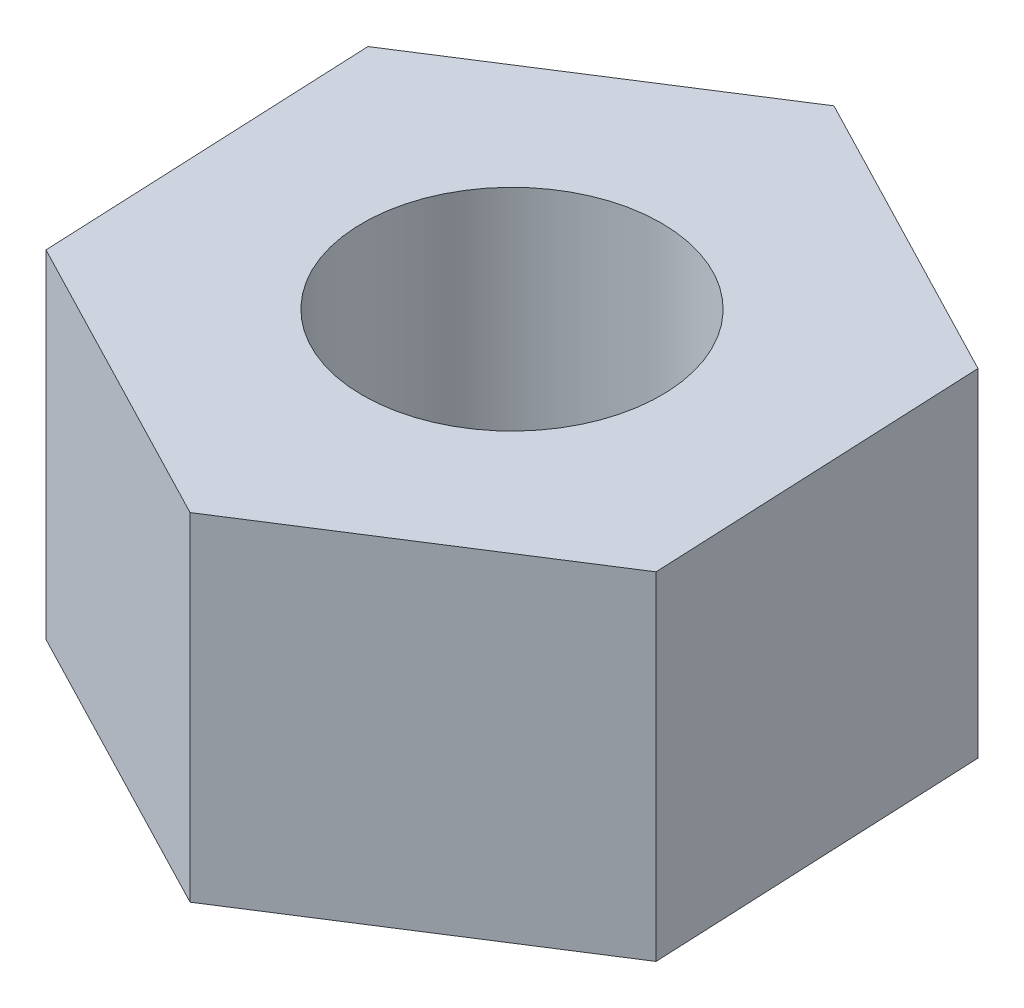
ISO-10303-21;
HEADER;
FILE_DESCRIPTION(('STEP AP214'),'2;1');
FILE_NAME('part.step','',(''),(''),'','','');
FILE_SCHEMA(('AUTOMOTIVE_DESIGN { 1 0 10303 214 1 1 1 1 }'));
ENDSEC;
DATA;
#1=APPLICATION_CONTEXT('core data for automotive mechanical design processes');
#2=APPLICATION_PROTOCOL_DEFINITION('international standard','automotive_design',2000,#1);
#3=PRODUCT_CONTEXT('',#1,'mechanical');
#4=PRODUCT('Part','Part','',(#3));
#5=PRODUCT_RELATED_PRODUCT_CATEGORY('part','',(#4));
#6=PRODUCT_DEFINITION_FORMATION('','',#4);
#7=PRODUCT_DEFINITION_CONTEXT('part definition',#1,'design');
#8=PRODUCT_DEFINITION('design','',#6,#7);
#9=PRODUCT_DEFINITION_SHAPE('','',#8);
#10=(LENGTH_UNIT() NAMED_UNIT(*) SI_UNIT(.MILLI.,.METRE.));
#11=(NAMED_UNIT(*) PLANE_ANGLE_UNIT() SI_UNIT($,.RADIAN.));
#12=(NAMED_UNIT(*) SI_UNIT($,.STERADIAN.) SOLID_ANGLE_UNIT());
#13=UNCERTAINTY_MEASURE_WITH_UNIT(LENGTH_MEASURE(1.E-05),#10,'distance_accuracy_value','');
#14=(GEOMETRIC_REPRESENTATION_CONTEXT(3) GLOBAL_UNCERTAINTY_ASSIGNED_CONTEXT((#13)) GLOBAL_UNIT_ASSIGNED_CONTEXT((#10,
#11,#12)) REPRESENTATION_CONTEXT('',''));
#15=CARTESIAN_POINT('',(0.,0.,0.));
#16=DIRECTION('',(0.,0.,1.));
#17=DIRECTION('',(1.,0.,0.));
#18=AXIS2_PLACEMENT_3D('',#15,#16,#17);
#19=CARTESIAN_POINT('',(0.,-5.08,0.));
#20=DIRECTION('',(0.,-1.,0.));
#21=DIRECTION('',(0.,0.,-1.));
#22=AXIS2_PLACEMENT_3D('',#19,#20,#21);
#23=PLANE('',#22);
#24=DIRECTION('',(0.88758893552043,0.,0.460636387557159));
#25=VECTOR('',#24,1.);
#26=CARTESIAN_POINT('',(-108.538835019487,-5.08,49.0979986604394));
#27=LINE('',#26,#25);
#28=CARTESIAN_POINT('',(-108.538835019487,-5.08,49.0979986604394));
#29=VERTEX_POINT('',#28);
#30=CARTESIAN_POINT('',(-104.029883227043,-5.08,51.4380315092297));
#31=VERTEX_POINT('',#30);
#32=EDGE_CURVE('E129',#29,#31,#27,.T.);
#33=ORIENTED_EDGE('',*,*,#32,.T.);
#34=DIRECTION('',(0.0448716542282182,0.,0.998992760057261));
#35=VECTOR('',#34,1.);
#36=CARTESIAN_POINT('',(-104.029883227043,-5.08,51.4380315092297));
#37=LINE('',#36,#35);
#38=CARTESIAN_POINT('',(-103.801935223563,-5.08,56.5129147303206));
#39=VERTEX_POINT('',#38);
#40=EDGE_CURVE('E87',#31,#39,#37,.T.);
#41=ORIENTED_EDGE('',*,*,#40,.T.);
#42=DIRECTION('',(-0.842717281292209,0.,0.538356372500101));
#43=VECTOR('',#42,1.);
#44=CARTESIAN_POINT('',(-103.801935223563,-5.08,56.5129147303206));
#45=LINE('',#44,#43);
#46=CARTESIAN_POINT('',(-108.082939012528,-5.08,59.2477651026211));
#47=VERTEX_POINT('',#46);
#48=EDGE_CURVE('E100',#39,#47,#45,.T.);
#49=ORIENTED_EDGE('',*,*,#48,.T.);
#50=DIRECTION('',(-0.88758893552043,0.,-0.46063638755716));
#51=VECTOR('',#50,1.);
#52=CARTESIAN_POINT('',(-108.082939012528,-5.08,59.2477651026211));
#53=LINE('',#52,#51);
#54=CARTESIAN_POINT('',(-112.591890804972,-5.08,56.9077322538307));
#55=VERTEX_POINT('',#54);
#56=EDGE_CURVE('E94',#47,#55,#53,.T.);
#57=ORIENTED_EDGE('',*,*,#56,.T.);
#58=DIRECTION('',(-0.0448716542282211,0.,-0.99899276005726));
#59=VECTOR('',#58,1.);
#60=CARTESIAN_POINT('',(-112.591890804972,-5.08,56.9077322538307));
#61=LINE('',#60,#59);
#62=CARTESIAN_POINT('',(-112.819838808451,-5.08,51.8328490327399));
#63=VERTEX_POINT('',#62);
#64=EDGE_CURVE('E98',#55,#63,#61,.T.);
#65=ORIENTED_EDGE('',*,*,#64,.T.);
#66=DIRECTION('',(0.84271728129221,0.,-0.5383563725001));
#67=VECTOR('',#66,1.);
#68=CARTESIAN_POINT('',(-112.819838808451,-5.08,51.8328490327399));
#69=LINE('',#68,#67);
#70=EDGE_CURVE('E50',#63,#29,#69,.T.);
#71=ORIENTED_EDGE('',*,*,#70,.T.);
#72=EDGE_LOOP('',(#33,#41,#49,#57,#65,#71));
#73=FACE_BOUND('',#72,.T.);
#74=CARTESIAN_POINT('',(-108.310887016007,-5.08,54.1728818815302));
#75=DIRECTION('',(0.,-1.,0.));
#76=DIRECTION('',(0.,0.,-1.));
#77=AXIS2_PLACEMENT_3D('',#74,#75,#76);
#78=CIRCLE('',#77,2.24789999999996);
#79=CARTESIAN_POINT('',(-108.310887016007,-5.08,51.9249818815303));
#80=VERTEX_POINT('',#79);
#81=EDGE_CURVE('E122',#80,#80,#78,.T.);
#82=ORIENTED_EDGE('',*,*,#81,.F.);
#83=EDGE_LOOP('',(#82));
#84=FACE_BOUND('',#83,.T.);
#85=ADVANCED_FACE('F33',(#73,#84),#23,.T.);
#86=CARTESIAN_POINT('',(0.,0.,0.));
#87=DIRECTION('',(0.,-1.,0.));
#88=DIRECTION('',(0.,0.,-1.));
#89=AXIS2_PLACEMENT_3D('',#86,#87,#88);
#90=PLANE('',#89);
#91=DIRECTION('',(0.88758893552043,0.,0.460636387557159));
#92=VECTOR('',#91,1.);
#93=CARTESIAN_POINT('',(-108.538835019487,0.,49.0979986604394));
#94=LINE('',#93,#92);
#95=CARTESIAN_POINT('',(-108.538835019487,0.,49.0979986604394));
#96=VERTEX_POINT('',#95);
#97=CARTESIAN_POINT('',(-104.029883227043,0.,51.4380315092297));
#98=VERTEX_POINT('',#97);
#99=EDGE_CURVE('E118',#96,#98,#94,.T.);
#100=ORIENTED_EDGE('',*,*,#99,.F.);
#101=DIRECTION('',(0.84271728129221,0.,-0.5383563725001));
#102=VECTOR('',#101,1.);
#103=CARTESIAN_POINT('',(-112.819838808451,0.,51.8328490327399));
#104=LINE('',#103,#102);
#105=CARTESIAN_POINT('',(-112.819838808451,0.,51.8328490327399));
#106=VERTEX_POINT('',#105);
#107=EDGE_CURVE('E79',#106,#96,#104,.T.);
#108=ORIENTED_EDGE('',*,*,#107,.F.);
#109=DIRECTION('',(-0.0448716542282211,0.,-0.99899276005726));
#110=VECTOR('',#109,1.);
#111=CARTESIAN_POINT('',(-112.591890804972,0.,56.9077322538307));
#112=LINE('',#111,#110);
#113=CARTESIAN_POINT('',(-112.591890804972,0.,56.9077322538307));
#114=VERTEX_POINT('',#113);
#115=EDGE_CURVE('E73',#114,#106,#112,.T.);
#116=ORIENTED_EDGE('',*,*,#115,.F.);
#117=DIRECTION('',(-0.88758893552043,0.,-0.46063638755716));
#118=VECTOR('',#117,1.);
#119=CARTESIAN_POINT('',(-108.082939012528,0.,59.2477651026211));
#120=LINE('',#119,#118);
#121=CARTESIAN_POINT('',(-108.082939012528,0.,59.2477651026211));
#122=VERTEX_POINT('',#121);
#123=EDGE_CURVE('E108',#122,#114,#120,.T.);
#124=ORIENTED_EDGE('',*,*,#123,.F.);
#125=DIRECTION('',(-0.842717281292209,0.,0.538356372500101));
#126=VECTOR('',#125,1.);
#127=CARTESIAN_POINT('',(-103.801935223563,0.,56.5129147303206));
#128=LINE('',#127,#126);
#129=CARTESIAN_POINT('',(-103.801935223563,0.,56.5129147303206));
#130=VERTEX_POINT('',#129);
#131=EDGE_CURVE('E124',#130,#122,#128,.T.);
#132=ORIENTED_EDGE('',*,*,#131,.F.);
#133=DIRECTION('',(0.0448716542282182,0.,0.998992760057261));
#134=VECTOR('',#133,1.);
#135=CARTESIAN_POINT('',(-104.029883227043,0.,51.4380315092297));
#136=LINE('',#135,#134);
#137=EDGE_CURVE('E121',#98,#130,#136,.T.);
#138=ORIENTED_EDGE('',*,*,#137,.F.);
#139=EDGE_LOOP('',(#100,#108,#116,#124,#132,#138));
#140=FACE_BOUND('',#139,.T.);
#141=CARTESIAN_POINT('',(-108.310887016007,0.,54.1728818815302));
#142=DIRECTION('',(0.,-1.,0.));
#143=DIRECTION('',(0.,0.,-1.));
#144=AXIS2_PLACEMENT_3D('',#141,#142,#143);
#145=CIRCLE('',#144,2.24789999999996);
#146=CARTESIAN_POINT('',(-108.310887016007,0.,51.9249818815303));
#147=VERTEX_POINT('',#146);
#148=EDGE_CURVE('E222',#147,#147,#145,.T.);
#149=ORIENTED_EDGE('',*,*,#148,.T.);
#150=EDGE_LOOP('',(#149));
#151=FACE_BOUND('',#150,.T.);
#152=ADVANCED_FACE('F138',(#140,#151),#90,.F.);
#153=CARTESIAN_POINT('',(-108.538835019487,-5.08,49.0979986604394));
#154=DIRECTION('',(-0.460636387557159,0.,0.88758893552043));
#155=DIRECTION('',(0.88758893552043,0.,0.460636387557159));
#156=AXIS2_PLACEMENT_3D('',#153,#154,#155);
#157=PLANE('',#156);
#158=ORIENTED_EDGE('',*,*,#99,.T.);
#159=DIRECTION('',(0.,1.,0.));
#160=VECTOR('',#159,1.);
#161=CARTESIAN_POINT('',(-104.029883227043,-5.08,51.4380315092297));
#162=LINE('',#161,#160);
#163=EDGE_CURVE('E11',#31,#98,#162,.T.);
#164=ORIENTED_EDGE('',*,*,#163,.F.);
#165=ORIENTED_EDGE('',*,*,#32,.F.);
#166=DIRECTION('',(0.,1.,0.));
#167=VECTOR('',#166,1.);
#168=CARTESIAN_POINT('',(-108.538835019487,-5.08,49.0979986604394));
#169=LINE('',#168,#167);
#170=EDGE_CURVE('E114',#29,#96,#169,.T.);
#171=ORIENTED_EDGE('',*,*,#170,.T.);
#172=EDGE_LOOP('',(#158,#164,#165,#171));
#173=FACE_BOUND('',#172,.T.);
#174=ADVANCED_FACE('F35',(#173),#157,.F.);
#175=CARTESIAN_POINT('',(-104.029883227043,-5.08,51.4380315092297));
#176=DIRECTION('',(-0.99899276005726,0.,0.0448716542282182));
#177=DIRECTION('',(0.0448716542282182,0.,0.99899276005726));
#178=AXIS2_PLACEMENT_3D('',#175,#176,#177);
#179=PLANE('',#178);
#180=ORIENTED_EDGE('',*,*,#137,.T.);
#181=DIRECTION('',(0.,1.,0.));
#182=VECTOR('',#181,1.);
#183=CARTESIAN_POINT('',(-103.801935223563,-5.08,56.5129147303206));
#184=LINE('',#183,#182);
#185=EDGE_CURVE('E42',#39,#130,#184,.T.);
#186=ORIENTED_EDGE('',*,*,#185,.F.);
#187=ORIENTED_EDGE('',*,*,#40,.F.);
#188=ORIENTED_EDGE('',*,*,#163,.T.);
#189=EDGE_LOOP('',(#180,#186,#187,#188));
#190=FACE_BOUND('',#189,.T.);
#191=ADVANCED_FACE('F163',(#190),#179,.F.);
#192=CARTESIAN_POINT('',(-103.801935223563,-5.08,56.5129147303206));
#193=DIRECTION('',(-0.538356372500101,0.,-0.842717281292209));
#194=DIRECTION('',(-0.842717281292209,0.,0.538356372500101));
#195=AXIS2_PLACEMENT_3D('',#192,#193,#194);
#196=PLANE('',#195);
#197=ORIENTED_EDGE('',*,*,#131,.T.);
#198=DIRECTION('',(0.,1.,0.));
#199=VECTOR('',#198,1.);
#200=CARTESIAN_POINT('',(-108.082939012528,-5.08,59.2477651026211));
#201=LINE('',#200,#199);
#202=EDGE_CURVE('E109',#47,#122,#201,.T.);
#203=ORIENTED_EDGE('',*,*,#202,.F.);
#204=ORIENTED_EDGE('',*,*,#48,.F.);
#205=ORIENTED_EDGE('',*,*,#185,.T.);
#206=EDGE_LOOP('',(#197,#203,#204,#205));
#207=FACE_BOUND('',#206,.T.);
#208=ADVANCED_FACE('F135',(#207),#196,.F.);
#209=CARTESIAN_POINT('',(-108.082939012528,-5.08,59.2477651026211));
#210=DIRECTION('',(0.46063638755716,0.,-0.88758893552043));
#211=DIRECTION('',(-0.88758893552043,0.,-0.46063638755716));
#212=AXIS2_PLACEMENT_3D('',#209,#210,#211);
#213=PLANE('',#212);
#214=ORIENTED_EDGE('',*,*,#123,.T.);
#215=DIRECTION('',(0.,1.,0.));
#216=VECTOR('',#215,1.);
#217=CARTESIAN_POINT('',(-112.591890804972,-5.08,56.9077322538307));
#218=LINE('',#217,#216);
#219=EDGE_CURVE('E105',#55,#114,#218,.T.);
#220=ORIENTED_EDGE('',*,*,#219,.F.);
#221=ORIENTED_EDGE('',*,*,#56,.F.);
#222=ORIENTED_EDGE('',*,*,#202,.T.);
#223=EDGE_LOOP('',(#214,#220,#221,#222));
#224=FACE_BOUND('',#223,.T.);
#225=ADVANCED_FACE('F106',(#224),#213,.F.);
#226=CARTESIAN_POINT('',(-112.591890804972,-5.08,56.9077322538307));
#227=DIRECTION('',(0.99899276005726,0.,-0.0448716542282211));
#228=DIRECTION('',(-0.0448716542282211,0.,-0.99899276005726));
#229=AXIS2_PLACEMENT_3D('',#226,#227,#228);
#230=PLANE('',#229);
#231=ORIENTED_EDGE('',*,*,#115,.T.);
#232=DIRECTION('',(0.,1.,0.));
#233=VECTOR('',#232,1.);
#234=CARTESIAN_POINT('',(-112.819838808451,-5.08,51.8328490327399));
#235=LINE('',#234,#233);
#236=EDGE_CURVE('E110',#63,#106,#235,.T.);
#237=ORIENTED_EDGE('',*,*,#236,.F.);
#238=ORIENTED_EDGE('',*,*,#64,.F.);
#239=ORIENTED_EDGE('',*,*,#219,.T.);
#240=EDGE_LOOP('',(#231,#237,#238,#239));
#241=FACE_BOUND('',#240,.T.);
#242=ADVANCED_FACE('F112',(#241),#230,.F.);
#243=CARTESIAN_POINT('',(-112.819838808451,-5.08,51.8328490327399));
#244=DIRECTION('',(0.5383563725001,0.,0.84271728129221));
#245=DIRECTION('',(0.84271728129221,0.,-0.5383563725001));
#246=AXIS2_PLACEMENT_3D('',#243,#244,#245);
#247=PLANE('',#246);
#248=ORIENTED_EDGE('',*,*,#107,.T.);
#249=ORIENTED_EDGE('',*,*,#170,.F.);
#250=ORIENTED_EDGE('',*,*,#70,.F.);
#251=ORIENTED_EDGE('',*,*,#236,.T.);
#252=EDGE_LOOP('',(#248,#249,#250,#251));
#253=FACE_BOUND('',#252,.T.);
#254=ADVANCED_FACE('F143',(#253),#247,.F.);
#255=CARTESIAN_POINT('',(-108.310887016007,-5.08,54.1728818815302));
#256=DIRECTION('',(0.,1.,0.));
#257=DIRECTION('',(0.,0.,1.));
#258=AXIS2_PLACEMENT_3D('',#255,#256,#257);
#259=CYLINDRICAL_SURFACE('',#258,2.24789999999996);
#260=ORIENTED_EDGE('',*,*,#81,.T.);
#261=EDGE_LOOP('',(#260));
#262=FACE_BOUND('',#261,.T.);
#263=ORIENTED_EDGE('',*,*,#148,.F.);
#264=EDGE_LOOP('',(#263));
#265=FACE_BOUND('',#264,.T.);
#266=ADVANCED_FACE('F145',(#262,#265),#259,.F.);
#267=CLOSED_SHELL('',(#85,#152,#174,#191,#208,#225,#242,#254,#266));
#268=MANIFOLD_SOLID_BREP('B2',#267);
#269=ADVANCED_BREP_SHAPE_REPRESENTATION('',(#18,#268),#14);
#270=SHAPE_DEFINITION_REPRESENTATION(#9,#269);
ENDSEC;
END-ISO-10303-21;
